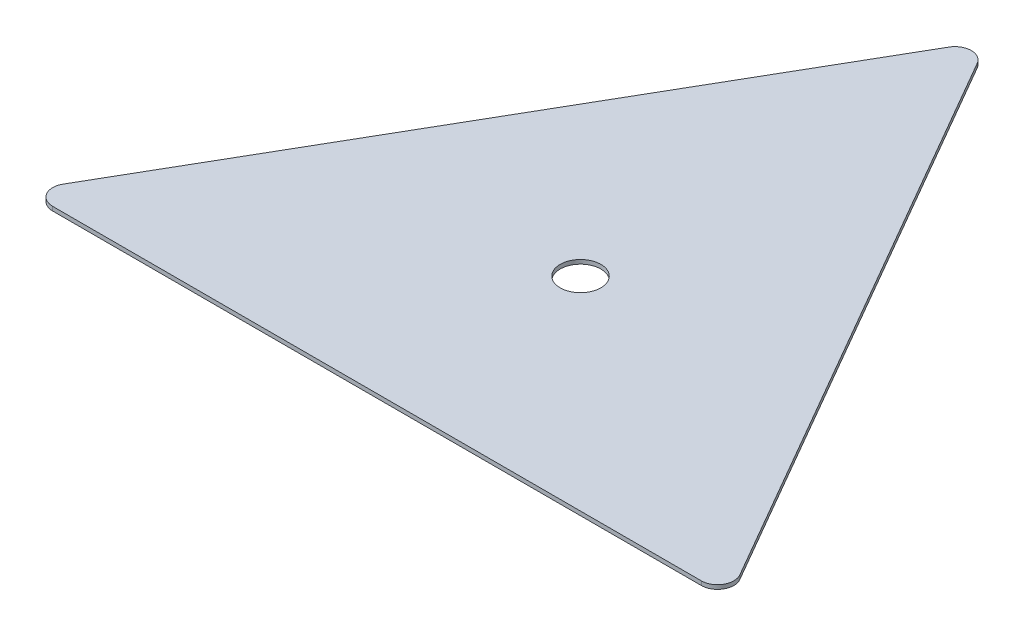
ISO-10303-21;
HEADER;
FILE_DESCRIPTION(('STEP AP214'),'2;1');
FILE_NAME('part.step','',(''),(''),'','','');
FILE_SCHEMA(('AUTOMOTIVE_DESIGN { 1 0 10303 214 1 1 1 1 }'));
ENDSEC;
DATA;
#1=APPLICATION_CONTEXT('core data for automotive mechanical design processes');
#2=APPLICATION_PROTOCOL_DEFINITION('international standard','automotive_design',2000,#1);
#3=PRODUCT_CONTEXT('',#1,'mechanical');
#4=PRODUCT('Part','Part','',(#3));
#5=PRODUCT_RELATED_PRODUCT_CATEGORY('part','',(#4));
#6=PRODUCT_DEFINITION_FORMATION('','',#4);
#7=PRODUCT_DEFINITION_CONTEXT('part definition',#1,'design');
#8=PRODUCT_DEFINITION('design','',#6,#7);
#9=PRODUCT_DEFINITION_SHAPE('','',#8);
#10=(LENGTH_UNIT() NAMED_UNIT(*) SI_UNIT(.MILLI.,.METRE.));
#11=(NAMED_UNIT(*) PLANE_ANGLE_UNIT() SI_UNIT($,.RADIAN.));
#12=(NAMED_UNIT(*) SI_UNIT($,.STERADIAN.) SOLID_ANGLE_UNIT());
#13=UNCERTAINTY_MEASURE_WITH_UNIT(LENGTH_MEASURE(1.E-05),#10,'distance_accuracy_value','');
#14=(GEOMETRIC_REPRESENTATION_CONTEXT(3) GLOBAL_UNCERTAINTY_ASSIGNED_CONTEXT((#13)) GLOBAL_UNIT_ASSIGNED_CONTEXT((#10,
#11,#12)) REPRESENTATION_CONTEXT('',''));
#15=CARTESIAN_POINT('',(0.,0.,0.));
#16=DIRECTION('',(0.,0.,1.));
#17=DIRECTION('',(1.,0.,0.));
#18=AXIS2_PLACEMENT_3D('',#15,#16,#17);
#19=CARTESIAN_POINT('',(0.,-0.5,-50.));
#20=DIRECTION('',(0.86602540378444,0.,-0.499999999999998));
#21=DIRECTION('',(-0.499999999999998,0.,-0.86602540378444));
#22=AXIS2_PLACEMENT_3D('',#19,#20,#21);
#23=PLANE('',#22);
#24=DIRECTION('',(-0.499999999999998,0.,-0.86602540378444));
#25=VECTOR('',#24,1.);
#26=CARTESIAN_POINT('',(0.,0.,-50.));
#27=LINE('',#26,#25);
#28=CARTESIAN_POINT('',(41.5692193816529,0.,22.0000000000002));
#29=VERTEX_POINT('',#28);
#30=CARTESIAN_POINT('',(1.73205080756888,0.,-47.));
#31=VERTEX_POINT('',#30);
#32=EDGE_CURVE('E82',#29,#31,#27,.T.);
#33=ORIENTED_EDGE('',*,*,#32,.F.);
#34=DIRECTION('',(0.,1.,0.));
#35=VECTOR('',#34,1.);
#36=CARTESIAN_POINT('',(41.5692193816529,-0.5,22.0000000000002));
#37=LINE('',#36,#35);
#38=CARTESIAN_POINT('',(41.5692193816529,-0.5,22.0000000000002));
#39=VERTEX_POINT('',#38);
#40=EDGE_CURVE('E11',#29,#39,#37,.F.);
#41=ORIENTED_EDGE('',*,*,#40,.T.);
#42=DIRECTION('',(-0.499999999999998,0.,-0.86602540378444));
#43=VECTOR('',#42,1.);
#44=CARTESIAN_POINT('',(0.,-0.5,-50.));
#45=LINE('',#44,#43);
#46=CARTESIAN_POINT('',(1.73205080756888,-0.5,-47.));
#47=VERTEX_POINT('',#46);
#48=EDGE_CURVE('E119',#39,#47,#45,.T.);
#49=ORIENTED_EDGE('',*,*,#48,.T.);
#50=DIRECTION('',(0.,1.,0.));
#51=VECTOR('',#50,1.);
#52=CARTESIAN_POINT('',(1.73205080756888,-0.5,-47.));
#53=LINE('',#52,#51);
#54=EDGE_CURVE('E33',#47,#31,#53,.T.);
#55=ORIENTED_EDGE('',*,*,#54,.T.);
#56=EDGE_LOOP('',(#33,#41,#49,#55));
#57=FACE_BOUND('',#56,.T.);
#58=ADVANCED_FACE('F26',(#57),#23,.T.);
#59=CARTESIAN_POINT('',(-43.3012701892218,-0.5,25.0000000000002));
#60=DIRECTION('',(0.,0.,1.));
#61=DIRECTION('',(1.,0.,0.));
#62=AXIS2_PLACEMENT_3D('',#59,#60,#61);
#63=PLANE('',#62);
#64=DIRECTION('',(1.,0.,0.));
#65=VECTOR('',#64,1.);
#66=CARTESIAN_POINT('',(-43.3012701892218,0.,25.0000000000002));
#67=LINE('',#66,#65);
#68=CARTESIAN_POINT('',(-39.8371685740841,0.,25.0000000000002));
#69=VERTEX_POINT('',#68);
#70=CARTESIAN_POINT('',(39.8371685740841,0.,25.0000000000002));
#71=VERTEX_POINT('',#70);
#72=EDGE_CURVE('E96',#69,#71,#67,.T.);
#73=ORIENTED_EDGE('',*,*,#72,.F.);
#74=DIRECTION('',(0.,1.,0.));
#75=VECTOR('',#74,1.);
#76=CARTESIAN_POINT('',(-39.8371685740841,-0.5,25.0000000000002));
#77=LINE('',#76,#75);
#78=CARTESIAN_POINT('',(-39.8371685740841,-0.5,25.0000000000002));
#79=VERTEX_POINT('',#78);
#80=EDGE_CURVE('E113',#69,#79,#77,.F.);
#81=ORIENTED_EDGE('',*,*,#80,.T.);
#82=DIRECTION('',(1.,0.,0.));
#83=VECTOR('',#82,1.);
#84=CARTESIAN_POINT('',(-43.3012701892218,-0.5,25.0000000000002));
#85=LINE('',#84,#83);
#86=CARTESIAN_POINT('',(39.8371685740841,-0.5,25.0000000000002));
#87=VERTEX_POINT('',#86);
#88=EDGE_CURVE('E99',#79,#87,#85,.T.);
#89=ORIENTED_EDGE('',*,*,#88,.T.);
#90=DIRECTION('',(0.,1.,0.));
#91=VECTOR('',#90,1.);
#92=CARTESIAN_POINT('',(39.8371685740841,-0.5,25.0000000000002));
#93=LINE('',#92,#91);
#94=EDGE_CURVE('E110',#87,#71,#93,.T.);
#95=ORIENTED_EDGE('',*,*,#94,.T.);
#96=EDGE_LOOP('',(#73,#81,#89,#95));
#97=FACE_BOUND('',#96,.T.);
#98=ADVANCED_FACE('F149',(#97),#63,.T.);
#99=CARTESIAN_POINT('',(0.,-0.5,-50.));
#100=DIRECTION('',(-0.86602540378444,0.,-0.499999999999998));
#101=DIRECTION('',(-0.499999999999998,0.,0.86602540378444));
#102=AXIS2_PLACEMENT_3D('',#99,#100,#101);
#103=PLANE('',#102);
#104=DIRECTION('',(-0.499999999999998,0.,0.86602540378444));
#105=VECTOR('',#104,1.);
#106=CARTESIAN_POINT('',(0.,-0.5,-50.));
#107=LINE('',#106,#105);
#108=CARTESIAN_POINT('',(-1.73205080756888,-0.5,-47.));
#109=VERTEX_POINT('',#108);
#110=CARTESIAN_POINT('',(-41.5692193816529,-0.5,22.0000000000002));
#111=VERTEX_POINT('',#110);
#112=EDGE_CURVE('E103',#109,#111,#107,.T.);
#113=ORIENTED_EDGE('',*,*,#112,.T.);
#114=DIRECTION('',(0.,1.,0.));
#115=VECTOR('',#114,1.);
#116=CARTESIAN_POINT('',(-41.5692193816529,-0.5,22.0000000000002));
#117=LINE('',#116,#115);
#118=CARTESIAN_POINT('',(-41.5692193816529,0.,22.0000000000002));
#119=VERTEX_POINT('',#118);
#120=EDGE_CURVE('E88',#111,#119,#117,.T.);
#121=ORIENTED_EDGE('',*,*,#120,.T.);
#122=DIRECTION('',(-0.499999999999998,0.,0.86602540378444));
#123=VECTOR('',#122,1.);
#124=CARTESIAN_POINT('',(0.,0.,-50.));
#125=LINE('',#124,#123);
#126=CARTESIAN_POINT('',(-1.73205080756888,0.,-47.));
#127=VERTEX_POINT('',#126);
#128=EDGE_CURVE('E81',#127,#119,#125,.T.);
#129=ORIENTED_EDGE('',*,*,#128,.F.);
#130=DIRECTION('',(0.,1.,0.));
#131=VECTOR('',#130,1.);
#132=CARTESIAN_POINT('',(-1.73205080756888,-0.5,-47.));
#133=LINE('',#132,#131);
#134=EDGE_CURVE('E94',#127,#109,#133,.F.);
#135=ORIENTED_EDGE('',*,*,#134,.T.);
#136=EDGE_LOOP('',(#113,#121,#129,#135));
#137=FACE_BOUND('',#136,.T.);
#138=ADVANCED_FACE('F93',(#137),#103,.T.);
#139=CARTESIAN_POINT('',(43.3012701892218,-0.5,25.0000000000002));
#140=DIRECTION('',(0.,1.,0.));
#141=DIRECTION('',(0.,0.,1.));
#142=AXIS2_PLACEMENT_3D('',#139,#140,#141);
#143=PLANE('',#142);
#144=CARTESIAN_POINT('',(0.,-0.5,0.));
#145=DIRECTION('',(0.,1.,0.));
#146=DIRECTION('',(0.,0.,1.));
#147=AXIS2_PLACEMENT_3D('',#144,#145,#146);
#148=CIRCLE('',#147,2.5);
#149=CARTESIAN_POINT('',(0.,-0.5,2.5));
#150=VERTEX_POINT('',#149);
#151=EDGE_CURVE('E126',#150,#150,#148,.T.);
#152=ORIENTED_EDGE('',*,*,#151,.T.);
#153=EDGE_LOOP('',(#152));
#154=FACE_BOUND('',#153,.T.);
#155=ORIENTED_EDGE('',*,*,#88,.F.);
#156=CARTESIAN_POINT('',(-39.8371685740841,-0.5,23.0000000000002));
#157=DIRECTION('',(0.,1.,0.));
#158=DIRECTION('',(0.,0.,1.));
#159=AXIS2_PLACEMENT_3D('',#156,#157,#158);
#160=CIRCLE('',#159,2.);
#161=EDGE_CURVE('E118',#79,#111,#160,.F.);
#162=ORIENTED_EDGE('',*,*,#161,.T.);
#163=ORIENTED_EDGE('',*,*,#112,.F.);
#164=CARTESIAN_POINT('',(0.,-0.5,-46.));
#165=DIRECTION('',(0.,1.,0.));
#166=DIRECTION('',(0.,0.,1.));
#167=AXIS2_PLACEMENT_3D('',#164,#165,#166);
#168=CIRCLE('',#167,2.);
#169=EDGE_CURVE('E40',#109,#47,#168,.F.);
#170=ORIENTED_EDGE('',*,*,#169,.T.);
#171=ORIENTED_EDGE('',*,*,#48,.F.);
#172=CARTESIAN_POINT('',(39.8371685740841,-0.5,23.0000000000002));
#173=DIRECTION('',(0.,1.,0.));
#174=DIRECTION('',(0.,0.,1.));
#175=AXIS2_PLACEMENT_3D('',#172,#173,#174);
#176=CIRCLE('',#175,2.);
#177=EDGE_CURVE('E116',#39,#87,#176,.F.);
#178=ORIENTED_EDGE('',*,*,#177,.T.);
#179=EDGE_LOOP('',(#155,#162,#163,#170,#171,#178));
#180=FACE_BOUND('',#179,.T.);
#181=ADVANCED_FACE('F136',(#154,#180),#143,.F.);
#182=CARTESIAN_POINT('',(43.3012701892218,0.,25.0000000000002));
#183=DIRECTION('',(0.,1.,0.));
#184=DIRECTION('',(0.,0.,1.));
#185=AXIS2_PLACEMENT_3D('',#182,#183,#184);
#186=PLANE('',#185);
#187=CARTESIAN_POINT('',(0.,0.,0.));
#188=DIRECTION('',(0.,1.,0.));
#189=DIRECTION('',(0.,0.,1.));
#190=AXIS2_PLACEMENT_3D('',#187,#188,#189);
#191=CIRCLE('',#190,2.5);
#192=CARTESIAN_POINT('',(0.,0.,2.5));
#193=VERTEX_POINT('',#192);
#194=EDGE_CURVE('E129',#193,#193,#191,.T.);
#195=ORIENTED_EDGE('',*,*,#194,.F.);
#196=EDGE_LOOP('',(#195));
#197=FACE_BOUND('',#196,.T.);
#198=ORIENTED_EDGE('',*,*,#128,.T.);
#199=CARTESIAN_POINT('',(-39.8371685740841,0.,23.0000000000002));
#200=DIRECTION('',(0.,1.,0.));
#201=DIRECTION('',(0.,0.,1.));
#202=AXIS2_PLACEMENT_3D('',#199,#200,#201);
#203=CIRCLE('',#202,2.);
#204=EDGE_CURVE('E108',#119,#69,#203,.T.);
#205=ORIENTED_EDGE('',*,*,#204,.T.);
#206=ORIENTED_EDGE('',*,*,#72,.T.);
#207=CARTESIAN_POINT('',(39.8371685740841,0.,23.0000000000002));
#208=DIRECTION('',(0.,1.,0.));
#209=DIRECTION('',(0.,0.,1.));
#210=AXIS2_PLACEMENT_3D('',#207,#208,#209);
#211=CIRCLE('',#210,2.);
#212=EDGE_CURVE('E87',#71,#29,#211,.T.);
#213=ORIENTED_EDGE('',*,*,#212,.T.);
#214=ORIENTED_EDGE('',*,*,#32,.T.);
#215=CARTESIAN_POINT('',(0.,0.,-46.));
#216=DIRECTION('',(0.,1.,0.));
#217=DIRECTION('',(0.,0.,1.));
#218=AXIS2_PLACEMENT_3D('',#215,#216,#217);
#219=CIRCLE('',#218,2.);
#220=EDGE_CURVE('E78',#31,#127,#219,.T.);
#221=ORIENTED_EDGE('',*,*,#220,.T.);
#222=EDGE_LOOP('',(#198,#205,#206,#213,#214,#221));
#223=FACE_BOUND('',#222,.T.);
#224=ADVANCED_FACE('F80',(#197,#223),#186,.T.);
#225=CARTESIAN_POINT('',(0.,-0.5,0.));
#226=DIRECTION('',(0.,1.,0.));
#227=DIRECTION('',(0.,0.,1.));
#228=AXIS2_PLACEMENT_3D('',#225,#226,#227);
#229=CYLINDRICAL_SURFACE('',#228,2.5);
#230=ORIENTED_EDGE('',*,*,#151,.F.);
#231=EDGE_LOOP('',(#230));
#232=FACE_BOUND('',#231,.T.);
#233=ORIENTED_EDGE('',*,*,#194,.T.);
#234=EDGE_LOOP('',(#233));
#235=FACE_BOUND('',#234,.T.);
#236=ADVANCED_FACE('F133',(#232,#235),#229,.F.);
#237=CARTESIAN_POINT('',(-39.8371685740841,-0.5,23.0000000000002));
#238=DIRECTION('',(0.,1.,0.));
#239=DIRECTION('',(0.,0.,1.));
#240=AXIS2_PLACEMENT_3D('',#237,#238,#239);
#241=CYLINDRICAL_SURFACE('',#240,2.);
#242=ORIENTED_EDGE('',*,*,#161,.F.);
#243=ORIENTED_EDGE('',*,*,#80,.F.);
#244=ORIENTED_EDGE('',*,*,#204,.F.);
#245=ORIENTED_EDGE('',*,*,#120,.F.);
#246=EDGE_LOOP('',(#242,#243,#244,#245));
#247=FACE_BOUND('',#246,.T.);
#248=ADVANCED_FACE('F143',(#247),#241,.T.);
#249=CARTESIAN_POINT('',(39.8371685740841,-0.5,23.0000000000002));
#250=DIRECTION('',(0.,1.,0.));
#251=DIRECTION('',(0.,0.,1.));
#252=AXIS2_PLACEMENT_3D('',#249,#250,#251);
#253=CYLINDRICAL_SURFACE('',#252,2.);
#254=ORIENTED_EDGE('',*,*,#177,.F.);
#255=ORIENTED_EDGE('',*,*,#40,.F.);
#256=ORIENTED_EDGE('',*,*,#212,.F.);
#257=ORIENTED_EDGE('',*,*,#94,.F.);
#258=EDGE_LOOP('',(#254,#255,#256,#257));
#259=FACE_BOUND('',#258,.T.);
#260=ADVANCED_FACE('F165',(#259),#253,.T.);
#261=CARTESIAN_POINT('',(0.,-0.5,-46.));
#262=DIRECTION('',(0.,1.,0.));
#263=DIRECTION('',(0.,0.,1.));
#264=AXIS2_PLACEMENT_3D('',#261,#262,#263);
#265=CYLINDRICAL_SURFACE('',#264,2.);
#266=ORIENTED_EDGE('',*,*,#169,.F.);
#267=ORIENTED_EDGE('',*,*,#134,.F.);
#268=ORIENTED_EDGE('',*,*,#220,.F.);
#269=ORIENTED_EDGE('',*,*,#54,.F.);
#270=EDGE_LOOP('',(#266,#267,#268,#269));
#271=FACE_BOUND('',#270,.T.);
#272=ADVANCED_FACE('F98',(#271),#265,.T.);
#273=CLOSED_SHELL('',(#58,#98,#138,#181,#224,#236,#248,#260,#272));
#274=MANIFOLD_SOLID_BREP('B2',#273);
#275=ADVANCED_BREP_SHAPE_REPRESENTATION('',(#18,#274),#14);
#276=SHAPE_DEFINITION_REPRESENTATION(#9,#275);
ENDSEC;
END-ISO-10303-21;
